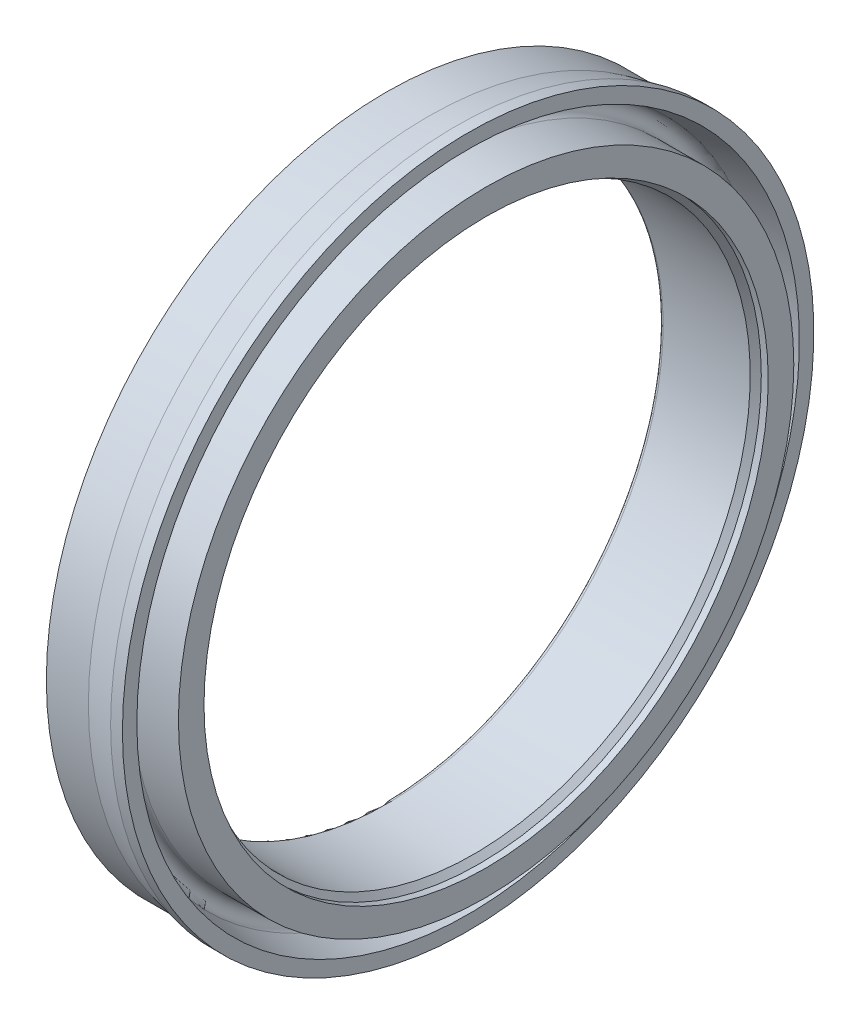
from build123d import *


with BuildPart() as part:
    # Esquisse1 → Base-R_volution (revolve)
    with BuildSketch(Plane.XY, mode=Mode.PRIVATE) as base_r_volution_sk:
        with BuildLine():
            Line((589.767712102, 442.563690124), (587.716906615, 442.119423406))
            Line((587.716906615, 442.119423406), (584.676027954, 442.119423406))
            Line((584.676027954, 442.119423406), (584.42124879, 441.463690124))
            Line((584.42124879, 441.463690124), (584.42124879, 437.863690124))
            add(Edge.make_bspline(
                [(584.42124879, 437.863690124), (584.42124879, 437.687954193), (584.545512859, 437.563690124), (584.72124879, 437.563690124)],
                knots=[0, 0, 0, 0, 1, 1, 1, 1], degree=3, weights=[1, 0.804737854, 0.804737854, 1]))
            Line((584.72124879, 437.563690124), (591.02124879, 437.563690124))
            Line((591.02124879, 437.563690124), (591.42124879, 437.963690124))
            Line((591.42124879, 437.963690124), (591.92124879, 437.963690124))
            Line((591.92124879, 437.963690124), (591.92124879, 439.813690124))
            Line((591.92124879, 439.813690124), (588.542408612, 439.813690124))
            add(Edge.make_bspline(
                [(588.410896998, 441.041928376), (587.415574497, 440.826311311), (587.523999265, 439.813690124), (588.542408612, 439.813690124)],
                knots=[0, 0, 0, 0, 1, 1, 1, 1], degree=3, weights=[1, 0.40430988, 0.40430988, 1]))
            Line((588.410896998, 441.041928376), (590.62124879, 441.520757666))
            Line((590.62124879, 441.520757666), (590.62124879, 442.563690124))
            Line((590.62124879, 442.563690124), (589.767712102, 442.563690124))
        make_face()
    revolve(base_r_volution_sk.sketch.rotate(Axis((562.739263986, 417.563690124, 0), (1, 0, 0)), 90), axis=Axis((562.739263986, 417.563690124, 0), (1, 0, 0)))


solid = part.part
